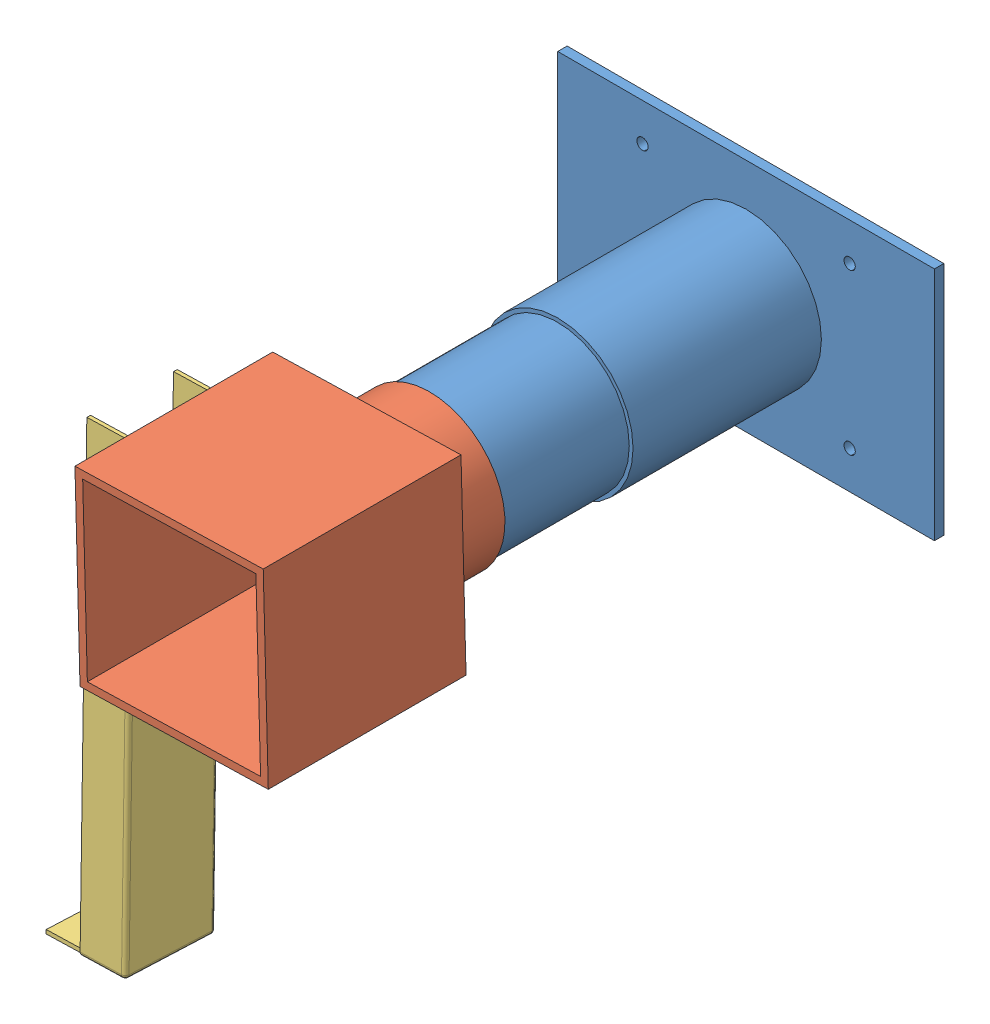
SolidWorks assembly Assemblage.SLDASM, configuration Défaut (file format 14000). Lengths in mm.
Overall size (200 260.67 310).
3 component instances, 3 part files, 4 mates.
Components (placement in the parent):
- Bati-1: Bati.SLDPRT [Défaut] at (-97.6342 -159.0077 26.1095) size (200 125 205)
- Bati_haut-1: Bati_haut.SLDPRT [Défaut] at (-100.2747 -164.7897 231.1095) x (-0.026923 0.999638 0) z (0 0 1) size (100 100 137)
- Bras-1: Bras.SLDPRT [Défaut] at (-148.2424 -240.923 286.9601) x (0.0269 -0.99876 0.041882) z (-0.999638 -0.026923 0) size (240 48 44)
Mates (geometry in assembly coordinates):
- Coïncidente1: coincident anti-aligned: plane of Bati-1 through (-100.2747 -164.7897 231.1095) normal (0 0 1); plane of Bati_haut-1 through (-100.2747 -164.7897 231.1095) normal (0 0 -1)
- Coaxiale1: concentric aligned: cylinder of Bati-1 through (-100.2747 -164.7897 131.1095) axis (0 0 1) radius 38; cylinder of Bati_haut-1 through (-100.2747 -164.7897 199.1095) axis (0 0 1) radius 36
- Coaxiale2: concentric aligned: cylinder of Bras-1 through (-150.3943 -161.0222 283.6095) axis (-0.999638 -0.026923 0) radius 2; cylinder of Bati_haut-1 through (-140.398 -160.7529 283.6095) axis (-0.999638 -0.026923 0) radius 2
- Coïncidente5: coincident anti-aligned: plane of Bati_haut-1 through (-148.9104 -216.1177 336.1095) normal (-0.999638 -0.026923 0); plane of Bras-1 through (-148.2424 -240.923 286.9601) normal (0.999638 0.026923 0)
